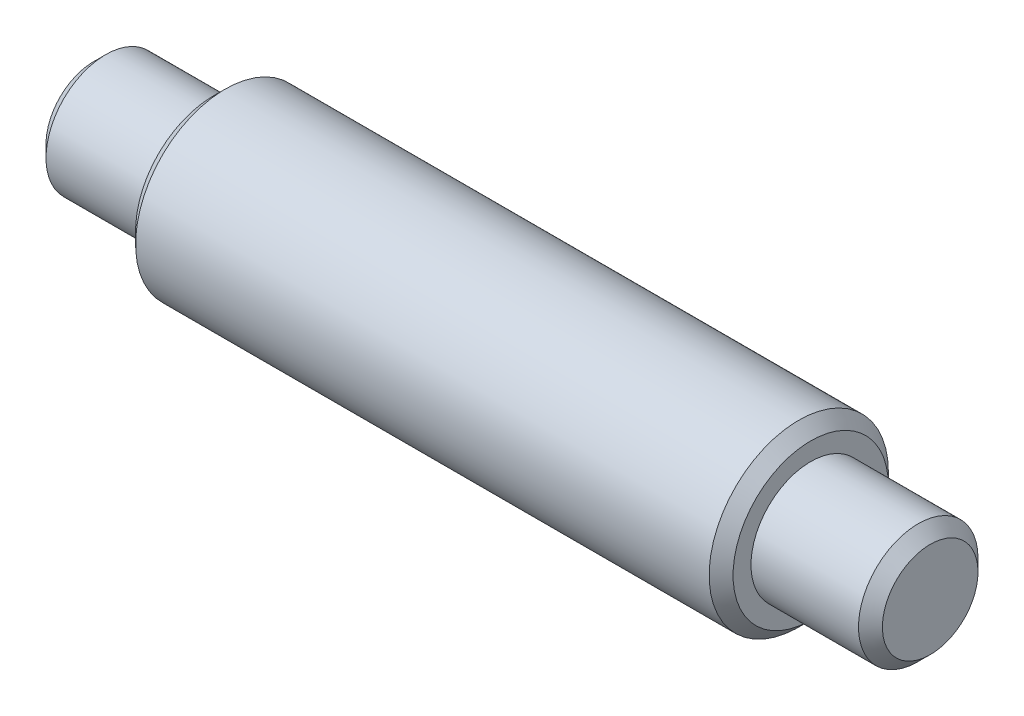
from build123d import *

# Parameters (mm, degrees)
SKETCH2_R                = 7.5
BOSS_EXTRUDE1_DEPTH      = 25
CHAMFER1_SIZE            = 1
SKETCH3_R                = 5
BOSS_EXTRUDE2_DEPTH      = 10
CHAMFER2_SIZE            = 1
CHAMFER2_OF_MIRROR2_SIZE = 1


with BuildPart() as part:
    # Sketch2 → Boss-Extrude1 (new, symmetric)
    with BuildSketch(Plane(origin=(0, 0, 0), x_dir=(0, 0, -1), z_dir=(1, 0, 0))):
        Circle(SKETCH2_R)
    extrude(amount=BOSS_EXTRUDE1_DEPTH, both=True)

    # Chamfer1
    chamfer1_edges = [part.edges().sort_by_distance(p)[0] for p in [
        (-25, 0, 7.5),
        (25, 0, 7.5),
    ]]
    chamfer(chamfer1_edges, length=CHAMFER1_SIZE)

    # Sketch3 → Boss-Extrude2 (add)
    with BuildSketch(Plane(origin=(25, 0, 0), x_dir=(0, 0, -1), z_dir=(1, 0, 0))):
        Circle(SKETCH3_R)
    boss_extrude2 = extrude(amount=BOSS_EXTRUDE2_DEPTH)

    # Chamfer2
    chamfer2_edges = [part.edges().sort_by_distance(p)[0] for p in [
        (35, 0, 5),
    ]]
    chamfer(chamfer2_edges, length=CHAMFER2_SIZE)

    # Mirror2: Boss-Extrude2 across plane
    add(boss_extrude2.mirror(Plane(origin=(0, 0, 0), x_dir=(0, 0, 1), z_dir=(1, 0, 0))))

    # Chamfer2 of Mirror2
    chamfer2_of_mirror2_edges = [part.edges().sort_by_distance(p)[0] for p in [
        (-35, 0, 5),
    ]]
    chamfer(chamfer2_of_mirror2_edges, length=CHAMFER2_OF_MIRROR2_SIZE)


solid = part.part
